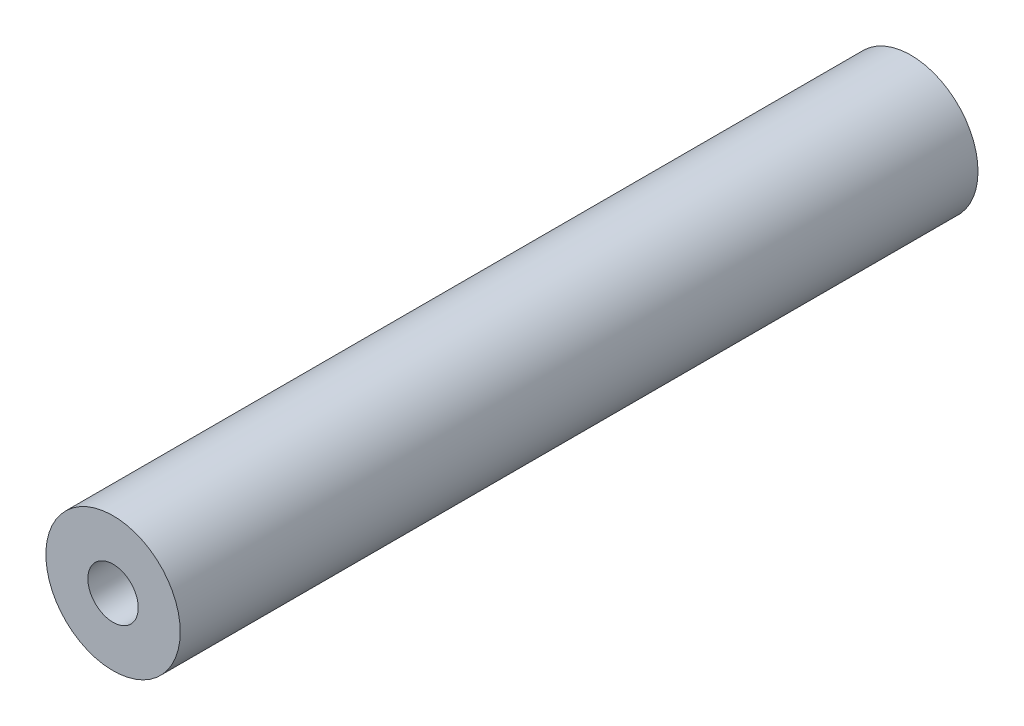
from build123d import *

# Parameters (mm, degrees)
SKETCH_1_R      = 8
SKETCH_1_R_2    = 3
EXTRUDE_1_DEPTH = 47.5


with BuildPart() as part:
    # Sketch 1 → Extrude 1 (new, symmetric)
    with BuildSketch(Plane.XY):
        Circle(SKETCH_1_R)
        Circle(SKETCH_1_R_2, mode=Mode.SUBTRACT)
    extrude(amount=EXTRUDE_1_DEPTH, both=True)


solid = part.part
